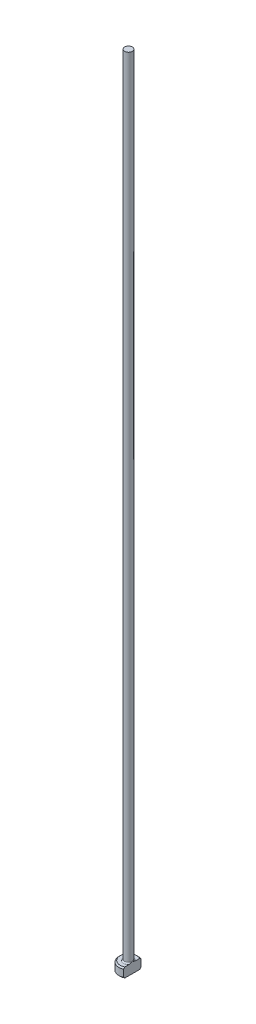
from build123d import *
from build123d.topology import SkipClean

# Parameters (mm, degrees)
CHAMFER1_SIZE = 0.2
FILLET1_R     = 0.2
KEY_DEPTH     = 126.017998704


with BuildPart() as part:
    # Sketch1 → Revolve1 (revolve)
    with BuildSketch(Plane.XY, mode=Mode.PRIVATE) as revolve1_sk:
        Polygon((0, 0), (-1.5, 0), (-1.5, 1.5), (-0.6, 1.5), (-0.6, 125), (0, 125), align=None)
    revolve(revolve1_sk.sketch.rotate(Axis((0, 259.958771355, 0), (0, -1, 0)), 270), axis=Axis((0, 259.958771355, 0), (0, -1, 0)))

    # Chamfer1
    chamfer1_edges = [part.edges().sort_by_distance(p)[0] for p in [
        (0, 1.5, -1.5),
        (0, 0, -1.5),
    ]]
    chamfer(chamfer1_edges, length=CHAMFER1_SIZE)

    # Fillet1
    fillet1_edges = [part.edges().sort_by_distance(p)[0] for p in [
        (0, 1.5, -0.6),
    ]]
    fillet(fillet1_edges, radius=FILLET1_R)

    # Sketch2 → KEY (cut, through all)
    with SkipClean():  # the faces are left unmerged after this step: merging them gives an invalid solid
        with BuildSketch(Plane(origin=(0, 0, 0), x_dir=(1, 0, 0), z_dir=(0, 1, 0))):
            with BuildLine():
                Line((0.6, 1.374772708), (0.6, -1.374772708))
                ThreePointArc((0.6, -1.374772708), (1.5, 0), (0.6, 1.374772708))
            make_face()
        extrude(amount=KEY_DEPTH, mode=Mode.SUBTRACT)


solid = part.part
